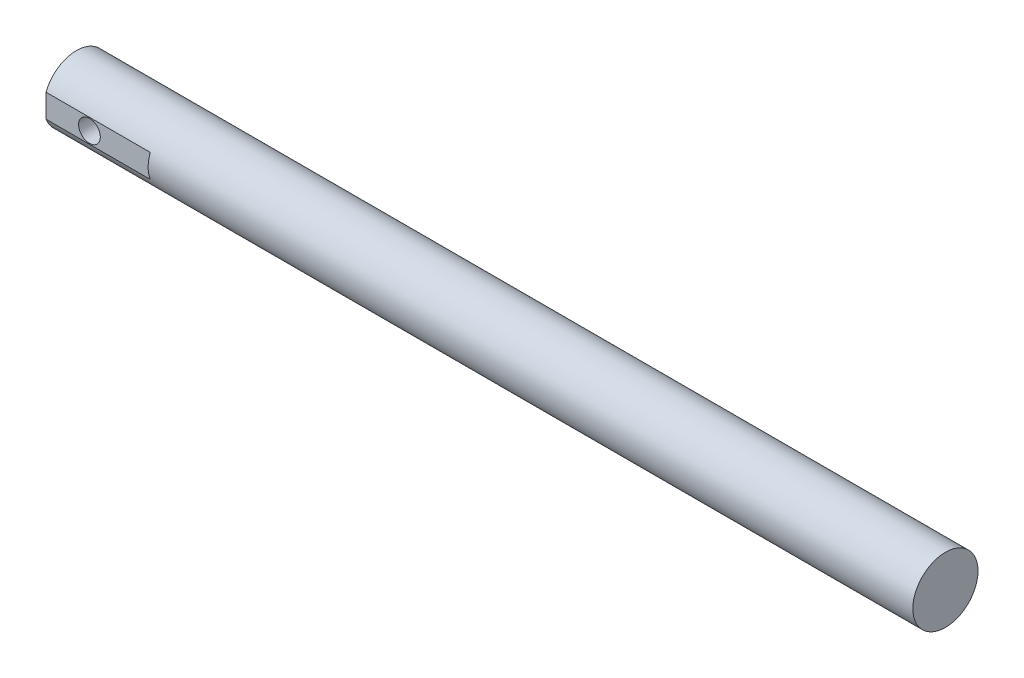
ISO-10303-21;
HEADER;
FILE_DESCRIPTION(('STEP AP214'),'2;1');
FILE_NAME('part.step','',(''),(''),'','','');
FILE_SCHEMA(('AUTOMOTIVE_DESIGN { 1 0 10303 214 1 1 1 1 }'));
ENDSEC;
DATA;
#1=APPLICATION_CONTEXT('core data for automotive mechanical design processes');
#2=APPLICATION_PROTOCOL_DEFINITION('international standard','automotive_design',2000,#1);
#3=PRODUCT_CONTEXT('',#1,'mechanical');
#4=PRODUCT('Part','Part','',(#3));
#5=PRODUCT_RELATED_PRODUCT_CATEGORY('part','',(#4));
#6=PRODUCT_DEFINITION_FORMATION('','',#4);
#7=PRODUCT_DEFINITION_CONTEXT('part definition',#1,'design');
#8=PRODUCT_DEFINITION('design','',#6,#7);
#9=PRODUCT_DEFINITION_SHAPE('','',#8);
#10=(LENGTH_UNIT() NAMED_UNIT(*) SI_UNIT(.MILLI.,.METRE.));
#11=(NAMED_UNIT(*) PLANE_ANGLE_UNIT() SI_UNIT($,.RADIAN.));
#12=(NAMED_UNIT(*) SI_UNIT($,.STERADIAN.) SOLID_ANGLE_UNIT());
#13=UNCERTAINTY_MEASURE_WITH_UNIT(LENGTH_MEASURE(1.E-05),#10,'distance_accuracy_value','');
#14=(GEOMETRIC_REPRESENTATION_CONTEXT(3) GLOBAL_UNCERTAINTY_ASSIGNED_CONTEXT((#13)) GLOBAL_UNIT_ASSIGNED_CONTEXT((#10,
#11,#12)) REPRESENTATION_CONTEXT('',''));
#15=CARTESIAN_POINT('',(0.,0.,0.));
#16=DIRECTION('',(0.,0.,1.));
#17=DIRECTION('',(1.,0.,0.));
#18=AXIS2_PLACEMENT_3D('',#15,#16,#17);
#19=CARTESIAN_POINT('',(127.,0.,0.));
#20=DIRECTION('',(-1.,0.,0.));
#21=DIRECTION('',(0.,0.,1.));
#22=AXIS2_PLACEMENT_3D('',#19,#20,#21);
#23=CYLINDRICAL_SURFACE('',#22,4.7625);
#24=CARTESIAN_POINT('',(127.,0.,0.));
#25=DIRECTION('',(1.,0.,0.));
#26=DIRECTION('',(0.,0.,-1.));
#27=AXIS2_PLACEMENT_3D('',#24,#25,#26);
#28=CIRCLE('',#27,4.7625);
#29=CARTESIAN_POINT('',(127.,0.,-4.7625));
#30=VERTEX_POINT('',#29);
#31=EDGE_CURVE('E11',#30,#30,#28,.T.);
#32=ORIENTED_EDGE('',*,*,#31,.F.);
#33=EDGE_LOOP('',(#32));
#34=FACE_BOUND('',#33,.T.);
#35=DIRECTION('',(-1.,0.,0.));
#36=VECTOR('',#35,1.);
#37=CARTESIAN_POINT('',(15.24,-1.70978982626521,-4.445));
#38=LINE('',#37,#36);
#39=CARTESIAN_POINT('',(15.24,-1.70978982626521,-4.445));
#40=VERTEX_POINT('',#39);
#41=CARTESIAN_POINT('',(0.,-1.70978982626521,-4.445));
#42=VERTEX_POINT('',#41);
#43=EDGE_CURVE('E48',#40,#42,#38,.T.);
#44=ORIENTED_EDGE('',*,*,#43,.F.);
#45=CARTESIAN_POINT('',(15.24,0.,0.));
#46=DIRECTION('',(-1.,0.,0.));
#47=DIRECTION('',(0.,0.,1.));
#48=AXIS2_PLACEMENT_3D('',#45,#46,#47);
#49=CIRCLE('',#48,4.7625);
#50=CARTESIAN_POINT('',(15.24,1.70978982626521,-4.445));
#51=VERTEX_POINT('',#50);
#52=EDGE_CURVE('E80',#51,#40,#49,.T.);
#53=ORIENTED_EDGE('',*,*,#52,.F.);
#54=DIRECTION('',(-1.,0.,0.));
#55=VECTOR('',#54,1.);
#56=CARTESIAN_POINT('',(15.24,1.70978982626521,-4.445));
#57=LINE('',#56,#55);
#58=CARTESIAN_POINT('',(0.,1.70978982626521,-4.445));
#59=VERTEX_POINT('',#58);
#60=EDGE_CURVE('E73',#51,#59,#57,.T.);
#61=ORIENTED_EDGE('',*,*,#60,.T.);
#62=CARTESIAN_POINT('',(0.,0.,0.));
#63=DIRECTION('',(1.,0.,0.));
#64=DIRECTION('',(0.,0.,-1.));
#65=AXIS2_PLACEMENT_3D('',#62,#63,#64);
#66=CIRCLE('',#65,4.7625);
#67=CARTESIAN_POINT('',(0.,1.70978982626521,4.445));
#68=VERTEX_POINT('',#67);
#69=EDGE_CURVE('E56',#59,#68,#66,.T.);
#70=ORIENTED_EDGE('',*,*,#69,.T.);
#71=DIRECTION('',(-1.,0.,0.));
#72=VECTOR('',#71,1.);
#73=CARTESIAN_POINT('',(15.24,1.70978982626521,4.445));
#74=LINE('',#73,#72);
#75=CARTESIAN_POINT('',(15.24,1.70978982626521,4.445));
#76=VERTEX_POINT('',#75);
#77=EDGE_CURVE('E97',#76,#68,#74,.T.);
#78=ORIENTED_EDGE('',*,*,#77,.F.);
#79=CARTESIAN_POINT('',(15.24,0.,0.));
#80=DIRECTION('',(-1.,0.,0.));
#81=DIRECTION('',(0.,0.,1.));
#82=AXIS2_PLACEMENT_3D('',#79,#80,#81);
#83=CIRCLE('',#82,4.7625);
#84=CARTESIAN_POINT('',(15.24,-1.7097898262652,4.445));
#85=VERTEX_POINT('',#84);
#86=EDGE_CURVE('E92',#85,#76,#83,.T.);
#87=ORIENTED_EDGE('',*,*,#86,.F.);
#88=DIRECTION('',(-1.,0.,0.));
#89=VECTOR('',#88,1.);
#90=CARTESIAN_POINT('',(15.24,-1.7097898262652,4.445));
#91=LINE('',#90,#89);
#92=CARTESIAN_POINT('',(0.,-1.7097898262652,4.445));
#93=VERTEX_POINT('',#92);
#94=EDGE_CURVE('E99',#85,#93,#91,.T.);
#95=ORIENTED_EDGE('',*,*,#94,.T.);
#96=EDGE_CURVE('E40',#93,#42,#66,.T.);
#97=ORIENTED_EDGE('',*,*,#96,.T.);
#98=EDGE_LOOP('',(#44,#53,#61,#70,#78,#87,#95,#97));
#99=FACE_BOUND('',#98,.T.);
#100=ADVANCED_FACE('F32',(#34,#99),#23,.T.);
#101=CARTESIAN_POINT('',(0.,0.,0.));
#102=DIRECTION('',(1.,0.,0.));
#103=DIRECTION('',(0.,0.,-1.));
#104=AXIS2_PLACEMENT_3D('',#101,#102,#103);
#105=PLANE('',#104);
#106=DIRECTION('',(0.,-1.,0.));
#107=VECTOR('',#106,1.);
#108=CARTESIAN_POINT('',(0.,-11.3278226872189,-4.445));
#109=LINE('',#108,#107);
#110=EDGE_CURVE('E78',#59,#42,#109,.T.);
#111=ORIENTED_EDGE('',*,*,#110,.T.);
#112=ORIENTED_EDGE('',*,*,#96,.F.);
#113=DIRECTION('',(0.,-1.,0.));
#114=VECTOR('',#113,1.);
#115=CARTESIAN_POINT('',(0.,-11.3278226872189,4.445));
#116=LINE('',#115,#114);
#117=EDGE_CURVE('E90',#68,#93,#116,.T.);
#118=ORIENTED_EDGE('',*,*,#117,.F.);
#119=ORIENTED_EDGE('',*,*,#69,.F.);
#120=EDGE_LOOP('',(#111,#112,#118,#119));
#121=FACE_BOUND('',#120,.T.);
#122=ADVANCED_FACE('F106',(#121),#105,.F.);
#123=CARTESIAN_POINT('',(127.,0.,0.));
#124=DIRECTION('',(1.,0.,0.));
#125=DIRECTION('',(0.,0.,-1.));
#126=AXIS2_PLACEMENT_3D('',#123,#124,#125);
#127=PLANE('',#126);
#128=ORIENTED_EDGE('',*,*,#31,.T.);
#129=EDGE_LOOP('',(#128));
#130=FACE_BOUND('',#129,.T.);
#131=ADVANCED_FACE('F120',(#130),#127,.T.);
#132=CARTESIAN_POINT('',(15.24,-11.3278226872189,4.445));
#133=DIRECTION('',(0.,0.,-1.));
#134=DIRECTION('',(0.,1.,0.));
#135=AXIS2_PLACEMENT_3D('',#132,#133,#134);
#136=PLANE('',#135);
#137=CARTESIAN_POINT('',(6.35,0.,4.445));
#138=DIRECTION('',(0.,0.,1.));
#139=DIRECTION('',(1.,0.,0.));
#140=AXIS2_PLACEMENT_3D('',#137,#138,#139);
#141=CIRCLE('',#140,1.5875);
#142=CARTESIAN_POINT('',(7.9375,0.,4.445));
#143=VERTEX_POINT('',#142);
#144=EDGE_CURVE('E175',#143,#143,#141,.T.);
#145=ORIENTED_EDGE('',*,*,#144,.F.);
#146=EDGE_LOOP('',(#145));
#147=FACE_BOUND('',#146,.T.);
#148=ORIENTED_EDGE('',*,*,#117,.T.);
#149=ORIENTED_EDGE('',*,*,#94,.F.);
#150=DIRECTION('',(0.,-1.,0.));
#151=VECTOR('',#150,1.);
#152=CARTESIAN_POINT('',(15.24,-11.3278226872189,4.445));
#153=LINE('',#152,#151);
#154=EDGE_CURVE('E94',#76,#85,#153,.T.);
#155=ORIENTED_EDGE('',*,*,#154,.F.);
#156=ORIENTED_EDGE('',*,*,#77,.T.);
#157=EDGE_LOOP('',(#148,#149,#155,#156));
#158=FACE_BOUND('',#157,.T.);
#159=ADVANCED_FACE('F108',(#147,#158),#136,.F.);
#160=CARTESIAN_POINT('',(15.24,-11.3278226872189,0.));
#161=DIRECTION('',(-1.,0.,0.));
#162=DIRECTION('',(0.,0.,1.));
#163=AXIS2_PLACEMENT_3D('',#160,#161,#162);
#164=PLANE('',#163);
#165=ORIENTED_EDGE('',*,*,#86,.T.);
#166=ORIENTED_EDGE('',*,*,#154,.T.);
#167=EDGE_LOOP('',(#165,#166));
#168=FACE_BOUND('',#167,.T.);
#169=ADVANCED_FACE('F111',(#168),#164,.T.);
#170=CARTESIAN_POINT('',(15.24,-11.3278226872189,-4.445));
#171=DIRECTION('',(0.,0.,-1.));
#172=DIRECTION('',(0.,1.,0.));
#173=AXIS2_PLACEMENT_3D('',#170,#171,#172);
#174=PLANE('',#173);
#175=CARTESIAN_POINT('',(6.35,0.,-4.445));
#176=DIRECTION('',(0.,0.,-1.));
#177=DIRECTION('',(0.,1.,0.));
#178=AXIS2_PLACEMENT_3D('',#175,#176,#177);
#179=CIRCLE('',#178,1.5875);
#180=CARTESIAN_POINT('',(6.35,1.5875,-4.445));
#181=VERTEX_POINT('',#180);
#182=EDGE_CURVE('E35',#181,#181,#179,.T.);
#183=ORIENTED_EDGE('',*,*,#182,.F.);
#184=EDGE_LOOP('',(#183));
#185=FACE_BOUND('',#184,.T.);
#186=ORIENTED_EDGE('',*,*,#110,.F.);
#187=ORIENTED_EDGE('',*,*,#60,.F.);
#188=DIRECTION('',(0.,-1.,0.));
#189=VECTOR('',#188,1.);
#190=CARTESIAN_POINT('',(15.24,-11.3278226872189,-4.445));
#191=LINE('',#190,#189);
#192=EDGE_CURVE('E76',#51,#40,#191,.T.);
#193=ORIENTED_EDGE('',*,*,#192,.T.);
#194=ORIENTED_EDGE('',*,*,#43,.T.);
#195=EDGE_LOOP('',(#186,#187,#193,#194));
#196=FACE_BOUND('',#195,.T.);
#197=ADVANCED_FACE('F75',(#185,#196),#174,.T.);
#198=CARTESIAN_POINT('',(15.24,-11.3278226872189,0.));
#199=DIRECTION('',(-1.,0.,0.));
#200=DIRECTION('',(0.,0.,1.));
#201=AXIS2_PLACEMENT_3D('',#198,#199,#200);
#202=PLANE('',#201);
#203=ORIENTED_EDGE('',*,*,#192,.F.);
#204=ORIENTED_EDGE('',*,*,#52,.T.);
#205=EDGE_LOOP('',(#203,#204));
#206=FACE_BOUND('',#205,.T.);
#207=ADVANCED_FACE('F83',(#206),#202,.T.);
#208=CARTESIAN_POINT('',(6.35,0.,-4.7625));
#209=DIRECTION('',(0.,0.,1.));
#210=DIRECTION('',(1.,0.,0.));
#211=AXIS2_PLACEMENT_3D('',#208,#209,#210);
#212=CYLINDRICAL_SURFACE('',#211,1.5875);
#213=ORIENTED_EDGE('',*,*,#182,.T.);
#214=EDGE_LOOP('',(#213));
#215=FACE_BOUND('',#214,.T.);
#216=ORIENTED_EDGE('',*,*,#144,.T.);
#217=EDGE_LOOP('',(#216));
#218=FACE_BOUND('',#217,.T.);
#219=ADVANCED_FACE('F157',(#215,#218),#212,.F.);
#220=CLOSED_SHELL('',(#100,#122,#131,#159,#169,#197,#207,#219));
#221=MANIFOLD_SOLID_BREP('B2',#220);
#222=ADVANCED_BREP_SHAPE_REPRESENTATION('',(#18,#221),#14);
#223=SHAPE_DEFINITION_REPRESENTATION(#9,#222);
ENDSEC;
END-ISO-10303-21;
